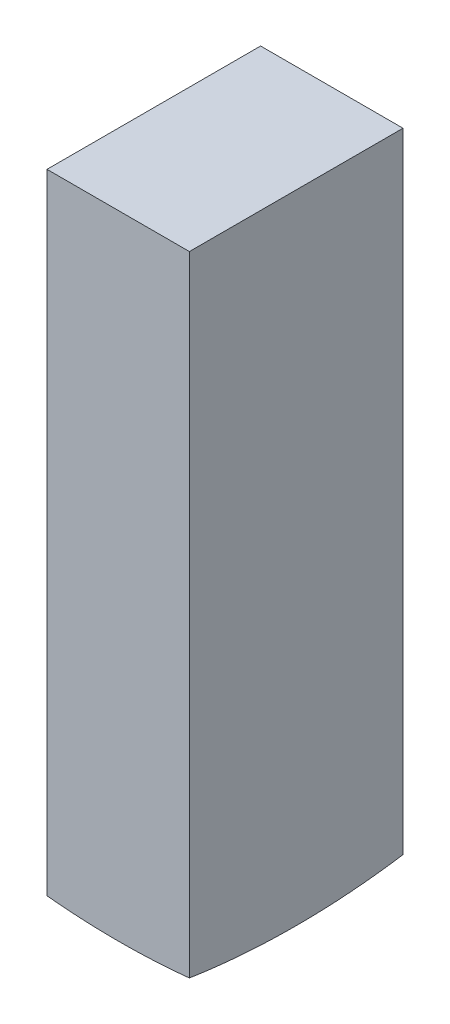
from build123d import *

# Parameters (mm, degrees)
ESQUISSE1_W      = 4
ESQUISSE1_H      = 18
EXTRUSION1_DEPTH = 3


with BuildPart() as part:
    # Esquisse1 → Extrusion1 (new, symmetric)
    with BuildSketch(Plane.XY):
        with Locations((0, 9)):
            Rectangle(ESQUISSE1_W, ESQUISSE1_H)
    extrude(amount=EXTRUSION1_DEPTH, both=True)

    # Esquisse2 → Enl_vement de mati_re-R_volution3 (revolve, cut)
    with BuildSketch(Plane.XY, mode=Mode.PRIVATE) as enl_vement_de_mati_re_r_volution3_sk:
        with BuildLine():
            Line((-4.055194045, 0.415429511), (-4.055194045, -1.001391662))
            Line((-4.055194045, -1.001391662), (0, -1.001391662))
            Line((0, -1.001391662), (0, 0))
            ThreePointArc((0, 0), (-2.038208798, 0.104128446), (-4.055194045, 0.415429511))
        make_face()
    revolve(enl_vement_de_mati_re_r_volution3_sk.sketch.rotate(Axis((0, -1.001391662, 0), (0, 1, 0)), 180), axis=Axis((0, -1.001391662, 0), (0, 1, 0)), mode=Mode.SUBTRACT)


solid = part.part
